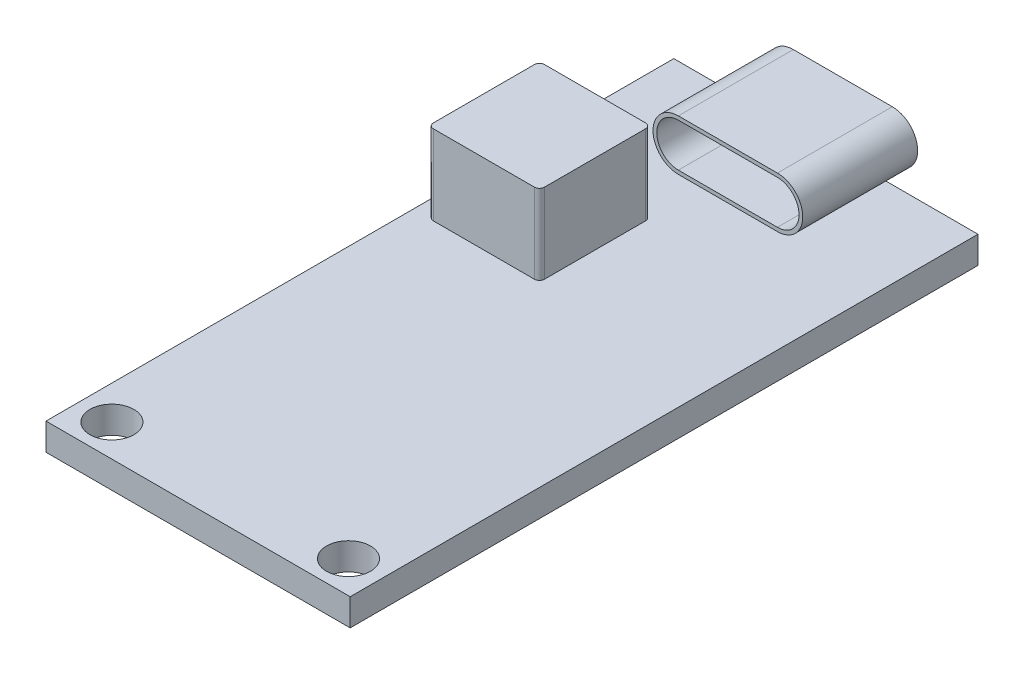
ISO-10303-21;
HEADER;
FILE_DESCRIPTION(('STEP AP214'),'2;1');
FILE_NAME('part.step','',(''),(''),'','','');
FILE_SCHEMA(('AUTOMOTIVE_DESIGN { 1 0 10303 214 1 1 1 1 }'));
ENDSEC;
DATA;
#1=APPLICATION_CONTEXT('core data for automotive mechanical design processes');
#2=APPLICATION_PROTOCOL_DEFINITION('international standard','automotive_design',2000,#1);
#3=PRODUCT_CONTEXT('',#1,'mechanical');
#4=PRODUCT('Part','Part','',(#3));
#5=PRODUCT_RELATED_PRODUCT_CATEGORY('part','',(#4));
#6=PRODUCT_DEFINITION_FORMATION('','',#4);
#7=PRODUCT_DEFINITION_CONTEXT('part definition',#1,'design');
#8=PRODUCT_DEFINITION('design','',#6,#7);
#9=PRODUCT_DEFINITION_SHAPE('','',#8);
#10=(LENGTH_UNIT() NAMED_UNIT(*) SI_UNIT(.MILLI.,.METRE.));
#11=(NAMED_UNIT(*) PLANE_ANGLE_UNIT() SI_UNIT($,.RADIAN.));
#12=(NAMED_UNIT(*) SI_UNIT($,.STERADIAN.) SOLID_ANGLE_UNIT());
#13=UNCERTAINTY_MEASURE_WITH_UNIT(LENGTH_MEASURE(1.E-05),#10,'distance_accuracy_value','');
#14=(GEOMETRIC_REPRESENTATION_CONTEXT(3) GLOBAL_UNCERTAINTY_ASSIGNED_CONTEXT((#13)) GLOBAL_UNIT_ASSIGNED_CONTEXT((#10,
#11,#12)) REPRESENTATION_CONTEXT('',''));
#15=CARTESIAN_POINT('',(0.,0.,0.));
#16=DIRECTION('',(0.,0.,1.));
#17=DIRECTION('',(1.,0.,0.));
#18=AXIS2_PLACEMENT_3D('',#15,#16,#17);
#19=CARTESIAN_POINT('',(0.,1.6,0.));
#20=DIRECTION('',(0.,1.,0.));
#21=DIRECTION('',(0.,0.,1.));
#22=AXIS2_PLACEMENT_3D('',#19,#20,#21);
#23=PLANE('',#22);
#24=CARTESIAN_POINT('',(-7.,1.6,16.675));
#25=DIRECTION('',(0.,1.,0.));
#26=DIRECTION('',(0.,0.,1.));
#27=AXIS2_PLACEMENT_3D('',#24,#25,#26);
#28=CIRCLE('',#27,1.3);
#29=CARTESIAN_POINT('',(-7.,1.6,17.975));
#30=VERTEX_POINT('',#29);
#31=EDGE_CURVE('E296',#30,#30,#28,.T.);
#32=ORIENTED_EDGE('',*,*,#31,.F.);
#33=EDGE_LOOP('',(#32));
#34=FACE_BOUND('',#33,.T.);
#35=CARTESIAN_POINT('',(7.,1.6,16.675));
#36=DIRECTION('',(0.,1.,0.));
#37=DIRECTION('',(0.,0.,1.));
#38=AXIS2_PLACEMENT_3D('',#35,#36,#37);
#39=CIRCLE('',#38,1.3);
#40=CARTESIAN_POINT('',(7.,1.6,17.975));
#41=VERTEX_POINT('',#40);
#42=EDGE_CURVE('E300',#41,#41,#39,.T.);
#43=ORIENTED_EDGE('',*,*,#42,.F.);
#44=EDGE_LOOP('',(#43));
#45=FACE_BOUND('',#44,.T.);
#46=DIRECTION('',(-1.,0.,0.));
#47=VECTOR('',#46,1.);
#48=CARTESIAN_POINT('',(-2.93,1.6,-12.775));
#49=LINE('',#48,#47);
#50=CARTESIAN_POINT('',(2.93,1.6,-12.775));
#51=VERTEX_POINT('',#50);
#52=CARTESIAN_POINT('',(-2.93,1.6,-12.775));
#53=VERTEX_POINT('',#52);
#54=EDGE_CURVE('E270',#51,#53,#49,.T.);
#55=ORIENTED_EDGE('',*,*,#54,.T.);
#56=DIRECTION('',(0.,0.,-1.));
#57=VECTOR('',#56,1.);
#58=CARTESIAN_POINT('',(-2.93,1.6,-12.775));
#59=LINE('',#58,#57);
#60=CARTESIAN_POINT('',(-2.93,1.6,-18.575));
#61=VERTEX_POINT('',#60);
#62=EDGE_CURVE('E275',#53,#61,#59,.T.);
#63=ORIENTED_EDGE('',*,*,#62,.T.);
#64=DIRECTION('',(-1.,0.,0.));
#65=VECTOR('',#64,1.);
#66=CARTESIAN_POINT('',(9.,1.6,-18.575));
#67=LINE('',#66,#65);
#68=CARTESIAN_POINT('',(-9.,1.6,-18.575));
#69=VERTEX_POINT('',#68);
#70=EDGE_CURVE('E318',#61,#69,#67,.T.);
#71=ORIENTED_EDGE('',*,*,#70,.T.);
#72=DIRECTION('',(0.,0.,1.));
#73=VECTOR('',#72,1.);
#74=CARTESIAN_POINT('',(-9.,1.6,18.575));
#75=LINE('',#74,#73);
#76=CARTESIAN_POINT('',(-9.,1.6,18.575));
#77=VERTEX_POINT('',#76);
#78=EDGE_CURVE('E307',#69,#77,#75,.T.);
#79=ORIENTED_EDGE('',*,*,#78,.T.);
#80=DIRECTION('',(1.,0.,0.));
#81=VECTOR('',#80,1.);
#82=CARTESIAN_POINT('',(9.,1.6,18.575));
#83=LINE('',#82,#81);
#84=CARTESIAN_POINT('',(9.,1.6,18.575));
#85=VERTEX_POINT('',#84);
#86=EDGE_CURVE('E311',#77,#85,#83,.T.);
#87=ORIENTED_EDGE('',*,*,#86,.T.);
#88=DIRECTION('',(0.,0.,-1.));
#89=VECTOR('',#88,1.);
#90=CARTESIAN_POINT('',(9.,1.6,18.575));
#91=LINE('',#90,#89);
#92=CARTESIAN_POINT('',(9.,1.6,-18.575));
#93=VERTEX_POINT('',#92);
#94=EDGE_CURVE('E315',#85,#93,#91,.T.);
#95=ORIENTED_EDGE('',*,*,#94,.T.);
#96=CARTESIAN_POINT('',(2.93,1.6,-18.575));
#97=VERTEX_POINT('',#96);
#98=EDGE_CURVE('E319',#93,#97,#67,.T.);
#99=ORIENTED_EDGE('',*,*,#98,.T.);
#100=DIRECTION('',(0.,0.,-1.));
#101=VECTOR('',#100,1.);
#102=CARTESIAN_POINT('',(2.93,1.6,-12.775));
#103=LINE('',#102,#101);
#104=EDGE_CURVE('E281',#51,#97,#103,.T.);
#105=ORIENTED_EDGE('',*,*,#104,.F.);
#106=EDGE_LOOP('',(#55,#63,#71,#79,#87,#95,#99,#105));
#107=FACE_BOUND('',#106,.T.);
#108=DIRECTION('',(-1.,0.,0.));
#109=VECTOR('',#108,1.);
#110=CARTESIAN_POINT('',(-8.1,1.6,-9.72500000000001));
#111=LINE('',#110,#109);
#112=CARTESIAN_POINT('',(-1.82,1.6,-9.72500000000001));
#113=VERTEX_POINT('',#112);
#114=CARTESIAN_POINT('',(-7.8,1.6,-9.72500000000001));
#115=VERTEX_POINT('',#114);
#116=EDGE_CURVE('E407',#113,#115,#111,.T.);
#117=ORIENTED_EDGE('',*,*,#116,.F.);
#118=CARTESIAN_POINT('',(-1.82,1.6,-9.42500000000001));
#119=DIRECTION('',(0.,1.,0.));
#120=DIRECTION('',(0.,0.,1.));
#121=AXIS2_PLACEMENT_3D('',#118,#119,#120);
#122=CIRCLE('',#121,0.3);
#123=CARTESIAN_POINT('',(-1.52,1.6,-9.42500000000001));
#124=VERTEX_POINT('',#123);
#125=EDGE_CURVE('E393',#113,#124,#122,.F.);
#126=ORIENTED_EDGE('',*,*,#125,.T.);
#127=DIRECTION('',(0.,0.,-1.));
#128=VECTOR('',#127,1.);
#129=CARTESIAN_POINT('',(-1.52,1.6,-9.72500000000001));
#130=LINE('',#129,#128);
#131=CARTESIAN_POINT('',(-1.52,1.6,-3.44500000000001));
#132=VERTEX_POINT('',#131);
#133=EDGE_CURVE('E428',#132,#124,#130,.T.);
#134=ORIENTED_EDGE('',*,*,#133,.F.);
#135=CARTESIAN_POINT('',(-1.82,1.6,-3.44500000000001));
#136=DIRECTION('',(0.,1.,0.));
#137=DIRECTION('',(0.,0.,1.));
#138=AXIS2_PLACEMENT_3D('',#135,#136,#137);
#139=CIRCLE('',#138,0.3);
#140=CARTESIAN_POINT('',(-1.82,1.6,-3.14500000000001));
#141=VERTEX_POINT('',#140);
#142=EDGE_CURVE('E11',#132,#141,#139,.F.);
#143=ORIENTED_EDGE('',*,*,#142,.T.);
#144=DIRECTION('',(1.,0.,0.));
#145=VECTOR('',#144,1.);
#146=CARTESIAN_POINT('',(-8.1,1.6,-3.14500000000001));
#147=LINE('',#146,#145);
#148=CARTESIAN_POINT('',(-7.8,1.6,-3.14500000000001));
#149=VERTEX_POINT('',#148);
#150=EDGE_CURVE('E400',#149,#141,#147,.T.);
#151=ORIENTED_EDGE('',*,*,#150,.F.);
#152=CARTESIAN_POINT('',(-7.8,1.6,-3.44500000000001));
#153=DIRECTION('',(0.,1.,0.));
#154=DIRECTION('',(0.,0.,1.));
#155=AXIS2_PLACEMENT_3D('',#152,#153,#154);
#156=CIRCLE('',#155,0.3);
#157=CARTESIAN_POINT('',(-8.1,1.6,-3.44500000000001));
#158=VERTEX_POINT('',#157);
#159=EDGE_CURVE('E52',#149,#158,#156,.F.);
#160=ORIENTED_EDGE('',*,*,#159,.T.);
#161=DIRECTION('',(0.,0.,1.));
#162=VECTOR('',#161,1.);
#163=CARTESIAN_POINT('',(-8.1,1.6,-9.72500000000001));
#164=LINE('',#163,#162);
#165=CARTESIAN_POINT('',(-8.1,1.6,-9.42500000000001));
#166=VERTEX_POINT('',#165);
#167=EDGE_CURVE('E399',#166,#158,#164,.T.);
#168=ORIENTED_EDGE('',*,*,#167,.F.);
#169=CARTESIAN_POINT('',(-7.8,1.6,-9.42500000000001));
#170=DIRECTION('',(0.,1.,0.));
#171=DIRECTION('',(0.,0.,1.));
#172=AXIS2_PLACEMENT_3D('',#169,#170,#171);
#173=CIRCLE('',#172,0.3);
#174=EDGE_CURVE('E390',#166,#115,#173,.F.);
#175=ORIENTED_EDGE('',*,*,#174,.T.);
#176=EDGE_LOOP('',(#117,#126,#134,#143,#151,#160,#168,#175));
#177=FACE_BOUND('',#176,.T.);
#178=ADVANCED_FACE('F43',(#34,#45,#107,#177),#23,.T.);
#179=CARTESIAN_POINT('',(-9.,1.6,18.575));
#180=DIRECTION('',(1.,0.,0.));
#181=DIRECTION('',(0.,0.,-1.));
#182=AXIS2_PLACEMENT_3D('',#179,#180,#181);
#183=PLANE('',#182);
#184=DIRECTION('',(0.,0.,1.));
#185=VECTOR('',#184,1.);
#186=CARTESIAN_POINT('',(-9.,0.,18.575));
#187=LINE('',#186,#185);
#188=CARTESIAN_POINT('',(-9.,0.,-18.575));
#189=VERTEX_POINT('',#188);
#190=CARTESIAN_POINT('',(-9.,0.,18.575));
#191=VERTEX_POINT('',#190);
#192=EDGE_CURVE('E295',#189,#191,#187,.T.);
#193=ORIENTED_EDGE('',*,*,#192,.T.);
#194=DIRECTION('',(0.,-1.,0.));
#195=VECTOR('',#194,1.);
#196=CARTESIAN_POINT('',(-9.,1.6,18.575));
#197=LINE('',#196,#195);
#198=EDGE_CURVE('E347',#77,#191,#197,.T.);
#199=ORIENTED_EDGE('',*,*,#198,.F.);
#200=ORIENTED_EDGE('',*,*,#78,.F.);
#201=DIRECTION('',(0.,-1.,0.));
#202=VECTOR('',#201,1.);
#203=CARTESIAN_POINT('',(-9.,1.6,-18.575));
#204=LINE('',#203,#202);
#205=EDGE_CURVE('E323',#69,#189,#204,.T.);
#206=ORIENTED_EDGE('',*,*,#205,.T.);
#207=EDGE_LOOP('',(#193,#199,#200,#206));
#208=FACE_BOUND('',#207,.T.);
#209=ADVANCED_FACE('F462',(#208),#183,.F.);
#210=CARTESIAN_POINT('',(9.,1.6,18.575));
#211=DIRECTION('',(0.,0.,-1.));
#212=DIRECTION('',(-1.,0.,0.));
#213=AXIS2_PLACEMENT_3D('',#210,#211,#212);
#214=PLANE('',#213);
#215=DIRECTION('',(1.,0.,0.));
#216=VECTOR('',#215,1.);
#217=CARTESIAN_POINT('',(9.,0.,18.575));
#218=LINE('',#217,#216);
#219=CARTESIAN_POINT('',(9.,0.,18.575));
#220=VERTEX_POINT('',#219);
#221=EDGE_CURVE('E328',#191,#220,#218,.T.);
#222=ORIENTED_EDGE('',*,*,#221,.T.);
#223=DIRECTION('',(0.,-1.,0.));
#224=VECTOR('',#223,1.);
#225=CARTESIAN_POINT('',(9.,1.6,18.575));
#226=LINE('',#225,#224);
#227=EDGE_CURVE('E343',#85,#220,#226,.T.);
#228=ORIENTED_EDGE('',*,*,#227,.F.);
#229=ORIENTED_EDGE('',*,*,#86,.F.);
#230=ORIENTED_EDGE('',*,*,#198,.T.);
#231=EDGE_LOOP('',(#222,#228,#229,#230));
#232=FACE_BOUND('',#231,.T.);
#233=ADVANCED_FACE('F468',(#232),#214,.F.);
#234=CARTESIAN_POINT('',(9.,1.6,18.575));
#235=DIRECTION('',(-1.,0.,0.));
#236=DIRECTION('',(0.,0.,1.));
#237=AXIS2_PLACEMENT_3D('',#234,#235,#236);
#238=PLANE('',#237);
#239=DIRECTION('',(0.,0.,-1.));
#240=VECTOR('',#239,1.);
#241=CARTESIAN_POINT('',(9.,0.,18.575));
#242=LINE('',#241,#240);
#243=CARTESIAN_POINT('',(9.,0.,-18.575));
#244=VERTEX_POINT('',#243);
#245=EDGE_CURVE('E331',#220,#244,#242,.T.);
#246=ORIENTED_EDGE('',*,*,#245,.T.);
#247=DIRECTION('',(0.,-1.,0.));
#248=VECTOR('',#247,1.);
#249=CARTESIAN_POINT('',(9.,1.6,-18.575));
#250=LINE('',#249,#248);
#251=EDGE_CURVE('E339',#93,#244,#250,.T.);
#252=ORIENTED_EDGE('',*,*,#251,.F.);
#253=ORIENTED_EDGE('',*,*,#94,.F.);
#254=ORIENTED_EDGE('',*,*,#227,.T.);
#255=EDGE_LOOP('',(#246,#252,#253,#254));
#256=FACE_BOUND('',#255,.T.);
#257=ADVANCED_FACE('F484',(#256),#238,.F.);
#258=CARTESIAN_POINT('',(9.,1.6,-18.575));
#259=DIRECTION('',(0.,0.,1.));
#260=DIRECTION('',(1.,0.,0.));
#261=AXIS2_PLACEMENT_3D('',#258,#259,#260);
#262=PLANE('',#261);
#263=DIRECTION('',(-1.,0.,0.));
#264=VECTOR('',#263,1.);
#265=CARTESIAN_POINT('',(9.,0.,-18.575));
#266=LINE('',#265,#264);
#267=EDGE_CURVE('E312',#244,#189,#266,.T.);
#268=ORIENTED_EDGE('',*,*,#267,.T.);
#269=ORIENTED_EDGE('',*,*,#205,.F.);
#270=ORIENTED_EDGE('',*,*,#70,.F.);
#271=EDGE_CURVE('E324',#97,#61,#67,.T.);
#272=ORIENTED_EDGE('',*,*,#271,.F.);
#273=ORIENTED_EDGE('',*,*,#98,.F.);
#274=ORIENTED_EDGE('',*,*,#251,.T.);
#275=EDGE_LOOP('',(#268,#269,#270,#272,#273,#274));
#276=FACE_BOUND('',#275,.T.);
#277=ADVANCED_FACE('F480',(#276),#262,.F.);
#278=CARTESIAN_POINT('',(0.,0.,0.));
#279=DIRECTION('',(0.,1.,0.));
#280=DIRECTION('',(0.,0.,1.));
#281=AXIS2_PLACEMENT_3D('',#278,#279,#280);
#282=PLANE('',#281);
#283=CARTESIAN_POINT('',(-7.,0.,16.675));
#284=DIRECTION('',(0.,1.,0.));
#285=DIRECTION('',(0.,0.,1.));
#286=AXIS2_PLACEMENT_3D('',#283,#284,#285);
#287=CIRCLE('',#286,1.3);
#288=CARTESIAN_POINT('',(-7.,0.,17.975));
#289=VERTEX_POINT('',#288);
#290=EDGE_CURVE('E291',#289,#289,#287,.T.);
#291=ORIENTED_EDGE('',*,*,#290,.T.);
#292=EDGE_LOOP('',(#291));
#293=FACE_BOUND('',#292,.T.);
#294=CARTESIAN_POINT('',(7.,0.,16.675));
#295=DIRECTION('',(0.,1.,0.));
#296=DIRECTION('',(0.,0.,1.));
#297=AXIS2_PLACEMENT_3D('',#294,#295,#296);
#298=CIRCLE('',#297,1.3);
#299=CARTESIAN_POINT('',(7.,0.,17.975));
#300=VERTEX_POINT('',#299);
#301=EDGE_CURVE('E279',#300,#300,#298,.T.);
#302=ORIENTED_EDGE('',*,*,#301,.T.);
#303=EDGE_LOOP('',(#302));
#304=FACE_BOUND('',#303,.T.);
#305=ORIENTED_EDGE('',*,*,#192,.F.);
#306=ORIENTED_EDGE('',*,*,#267,.F.);
#307=ORIENTED_EDGE('',*,*,#245,.F.);
#308=ORIENTED_EDGE('',*,*,#221,.F.);
#309=EDGE_LOOP('',(#305,#306,#307,#308));
#310=FACE_BOUND('',#309,.T.);
#311=ADVANCED_FACE('F477',(#293,#304,#310),#282,.F.);
#312=CARTESIAN_POINT('',(7.,0.,16.675));
#313=DIRECTION('',(0.,1.,0.));
#314=DIRECTION('',(0.,0.,1.));
#315=AXIS2_PLACEMENT_3D('',#312,#313,#314);
#316=CYLINDRICAL_SURFACE('',#315,1.3);
#317=ORIENTED_EDGE('',*,*,#301,.F.);
#318=EDGE_LOOP('',(#317));
#319=FACE_BOUND('',#318,.T.);
#320=ORIENTED_EDGE('',*,*,#42,.T.);
#321=EDGE_LOOP('',(#320));
#322=FACE_BOUND('',#321,.T.);
#323=ADVANCED_FACE('F475',(#319,#322),#316,.F.);
#324=CARTESIAN_POINT('',(-7.,0.,16.675));
#325=DIRECTION('',(0.,1.,0.));
#326=DIRECTION('',(0.,0.,1.));
#327=AXIS2_PLACEMENT_3D('',#324,#325,#326);
#328=CYLINDRICAL_SURFACE('',#327,1.3);
#329=ORIENTED_EDGE('',*,*,#290,.F.);
#330=EDGE_LOOP('',(#329));
#331=FACE_BOUND('',#330,.T.);
#332=ORIENTED_EDGE('',*,*,#31,.T.);
#333=EDGE_LOOP('',(#332));
#334=FACE_BOUND('',#333,.T.);
#335=ADVANCED_FACE('F660',(#331,#334),#328,.F.);
#336=CARTESIAN_POINT('',(-2.93,1.6,-12.775));
#337=DIRECTION('',(0.,-1.,0.));
#338=DIRECTION('',(0.,0.,-1.));
#339=AXIS2_PLACEMENT_3D('',#336,#337,#338);
#340=PLANE('',#339);
#341=ORIENTED_EDGE('',*,*,#271,.T.);
#342=CARTESIAN_POINT('',(-2.93,1.6,-19.575));
#343=VERTEX_POINT('',#342);
#344=EDGE_CURVE('E280',#61,#343,#59,.T.);
#345=ORIENTED_EDGE('',*,*,#344,.T.);
#346=DIRECTION('',(-1.,0.,0.));
#347=VECTOR('',#346,1.);
#348=CARTESIAN_POINT('',(-2.93,1.6,-19.575));
#349=LINE('',#348,#347);
#350=CARTESIAN_POINT('',(2.93,1.6,-19.575));
#351=VERTEX_POINT('',#350);
#352=EDGE_CURVE('E236',#351,#343,#349,.T.);
#353=ORIENTED_EDGE('',*,*,#352,.F.);
#354=EDGE_CURVE('E285',#97,#351,#103,.T.);
#355=ORIENTED_EDGE('',*,*,#354,.F.);
#356=EDGE_LOOP('',(#341,#345,#353,#355));
#357=FACE_BOUND('',#356,.T.);
#358=ADVANCED_FACE('F650',(#357),#340,.T.);
#359=CARTESIAN_POINT('',(-2.93,3.1,-12.775));
#360=DIRECTION('',(0.,0.,-1.));
#361=DIRECTION('',(-1.,0.,0.));
#362=AXIS2_PLACEMENT_3D('',#359,#360,#361);
#363=CYLINDRICAL_SURFACE('',#362,1.5);
#364=DIRECTION('',(0.,0.,-1.));
#365=VECTOR('',#364,1.);
#366=CARTESIAN_POINT('',(-2.93,4.6,-12.775));
#367=LINE('',#366,#365);
#368=CARTESIAN_POINT('',(-2.93,4.6,-12.775));
#369=VERTEX_POINT('',#368);
#370=CARTESIAN_POINT('',(-2.93,4.6,-19.575));
#371=VERTEX_POINT('',#370);
#372=EDGE_CURVE('E274',#369,#371,#367,.T.);
#373=ORIENTED_EDGE('',*,*,#372,.T.);
#374=CARTESIAN_POINT('',(-2.93,3.1,-19.575));
#375=DIRECTION('',(0.,0.,-1.));
#376=DIRECTION('',(-1.,0.,0.));
#377=AXIS2_PLACEMENT_3D('',#374,#375,#376);
#378=CIRCLE('',#377,1.5);
#379=EDGE_CURVE('E224',#343,#371,#378,.T.);
#380=ORIENTED_EDGE('',*,*,#379,.F.);
#381=ORIENTED_EDGE('',*,*,#344,.F.);
#382=ORIENTED_EDGE('',*,*,#62,.F.);
#383=CARTESIAN_POINT('',(-2.93,3.1,-12.775));
#384=DIRECTION('',(0.,0.,-1.));
#385=DIRECTION('',(-1.,0.,0.));
#386=AXIS2_PLACEMENT_3D('',#383,#384,#385);
#387=CIRCLE('',#386,1.5);
#388=EDGE_CURVE('E254',#53,#369,#387,.T.);
#389=ORIENTED_EDGE('',*,*,#388,.T.);
#390=EDGE_LOOP('',(#373,#380,#381,#382,#389));
#391=FACE_BOUND('',#390,.T.);
#392=ADVANCED_FACE('F640',(#391),#363,.T.);
#393=CARTESIAN_POINT('',(2.93,3.1,-12.775));
#394=DIRECTION('',(0.,0.,-1.));
#395=DIRECTION('',(-1.,0.,0.));
#396=AXIS2_PLACEMENT_3D('',#393,#394,#395);
#397=CYLINDRICAL_SURFACE('',#396,1.5);
#398=ORIENTED_EDGE('',*,*,#104,.T.);
#399=ORIENTED_EDGE('',*,*,#354,.T.);
#400=CARTESIAN_POINT('',(2.93,3.1,-19.575));
#401=DIRECTION('',(0.,0.,-1.));
#402=DIRECTION('',(-1.,0.,0.));
#403=AXIS2_PLACEMENT_3D('',#400,#401,#402);
#404=CIRCLE('',#403,1.5);
#405=CARTESIAN_POINT('',(2.93,4.6,-19.575));
#406=VERTEX_POINT('',#405);
#407=EDGE_CURVE('E232',#406,#351,#404,.T.);
#408=ORIENTED_EDGE('',*,*,#407,.F.);
#409=DIRECTION('',(0.,0.,-1.));
#410=VECTOR('',#409,1.);
#411=CARTESIAN_POINT('',(2.93,4.6,-12.775));
#412=LINE('',#411,#410);
#413=CARTESIAN_POINT('',(2.93,4.6,-12.775));
#414=VERTEX_POINT('',#413);
#415=EDGE_CURVE('E286',#414,#406,#412,.T.);
#416=ORIENTED_EDGE('',*,*,#415,.F.);
#417=CARTESIAN_POINT('',(2.93,3.1,-12.775));
#418=DIRECTION('',(0.,0.,-1.));
#419=DIRECTION('',(-1.,0.,0.));
#420=AXIS2_PLACEMENT_3D('',#417,#418,#419);
#421=CIRCLE('',#420,1.5);
#422=EDGE_CURVE('E267',#414,#51,#421,.T.);
#423=ORIENTED_EDGE('',*,*,#422,.T.);
#424=EDGE_LOOP('',(#398,#399,#408,#416,#423));
#425=FACE_BOUND('',#424,.T.);
#426=ADVANCED_FACE('F630',(#425),#397,.T.);
#427=CARTESIAN_POINT('',(-2.93,4.6,-12.775));
#428=DIRECTION('',(0.,1.,0.));
#429=DIRECTION('',(0.,0.,1.));
#430=AXIS2_PLACEMENT_3D('',#427,#428,#429);
#431=PLANE('',#430);
#432=ORIENTED_EDGE('',*,*,#415,.T.);
#433=DIRECTION('',(1.,0.,0.));
#434=VECTOR('',#433,1.);
#435=CARTESIAN_POINT('',(-2.93,4.6,-19.575));
#436=LINE('',#435,#434);
#437=EDGE_CURVE('E228',#371,#406,#436,.T.);
#438=ORIENTED_EDGE('',*,*,#437,.F.);
#439=ORIENTED_EDGE('',*,*,#372,.F.);
#440=DIRECTION('',(1.,0.,0.));
#441=VECTOR('',#440,1.);
#442=CARTESIAN_POINT('',(-2.93,4.6,-12.775));
#443=LINE('',#442,#441);
#444=EDGE_CURVE('E263',#369,#414,#443,.T.);
#445=ORIENTED_EDGE('',*,*,#444,.T.);
#446=EDGE_LOOP('',(#432,#438,#439,#445));
#447=FACE_BOUND('',#446,.T.);
#448=ADVANCED_FACE('F620',(#447),#431,.T.);
#449=CARTESIAN_POINT('',(-2.93,3.1,-12.775));
#450=DIRECTION('',(0.,0.,-1.));
#451=DIRECTION('',(-1.,0.,0.));
#452=AXIS2_PLACEMENT_3D('',#449,#450,#451);
#453=PLANE('',#452);
#454=DIRECTION('',(-1.,0.,0.));
#455=VECTOR('',#454,1.);
#456=CARTESIAN_POINT('',(-2.93,1.82,-12.775));
#457=LINE('',#456,#455);
#458=CARTESIAN_POINT('',(2.93,1.82,-12.775));
#459=VERTEX_POINT('',#458);
#460=CARTESIAN_POINT('',(-2.93,1.82,-12.775));
#461=VERTEX_POINT('',#460);
#462=EDGE_CURVE('E200',#459,#461,#457,.T.);
#463=ORIENTED_EDGE('',*,*,#462,.T.);
#464=CARTESIAN_POINT('',(-2.93,3.1,-12.775));
#465=DIRECTION('',(0.,0.,-1.));
#466=DIRECTION('',(-1.,0.,0.));
#467=AXIS2_PLACEMENT_3D('',#464,#465,#466);
#468=CIRCLE('',#467,1.28);
#469=CARTESIAN_POINT('',(-2.93,4.38,-12.775));
#470=VERTEX_POINT('',#469);
#471=EDGE_CURVE('E240',#461,#470,#468,.T.);
#472=ORIENTED_EDGE('',*,*,#471,.T.);
#473=DIRECTION('',(1.,0.,0.));
#474=VECTOR('',#473,1.);
#475=CARTESIAN_POINT('',(-2.93,4.38,-12.775));
#476=LINE('',#475,#474);
#477=CARTESIAN_POINT('',(2.93,4.38,-12.775));
#478=VERTEX_POINT('',#477);
#479=EDGE_CURVE('E194',#470,#478,#476,.T.);
#480=ORIENTED_EDGE('',*,*,#479,.T.);
#481=CARTESIAN_POINT('',(2.93,3.1,-12.775));
#482=DIRECTION('',(0.,0.,-1.));
#483=DIRECTION('',(-1.,0.,0.));
#484=AXIS2_PLACEMENT_3D('',#481,#482,#483);
#485=CIRCLE('',#484,1.28);
#486=EDGE_CURVE('E245',#478,#459,#485,.T.);
#487=ORIENTED_EDGE('',*,*,#486,.T.);
#488=EDGE_LOOP('',(#463,#472,#480,#487));
#489=FACE_BOUND('',#488,.T.);
#490=ORIENTED_EDGE('',*,*,#388,.F.);
#491=ORIENTED_EDGE('',*,*,#54,.F.);
#492=ORIENTED_EDGE('',*,*,#422,.F.);
#493=ORIENTED_EDGE('',*,*,#444,.F.);
#494=EDGE_LOOP('',(#490,#491,#492,#493));
#495=FACE_BOUND('',#494,.T.);
#496=ADVANCED_FACE('F611',(#489,#495),#453,.F.);
#497=CARTESIAN_POINT('',(-2.93,3.1,-12.775));
#498=DIRECTION('',(0.,0.,-1.));
#499=DIRECTION('',(-1.,0.,0.));
#500=AXIS2_PLACEMENT_3D('',#497,#498,#499);
#501=CYLINDRICAL_SURFACE('',#500,1.28);
#502=DIRECTION('',(0.,0.,-1.));
#503=VECTOR('',#502,1.);
#504=CARTESIAN_POINT('',(-2.93,1.82,-12.775));
#505=LINE('',#504,#503);
#506=CARTESIAN_POINT('',(-2.93,1.82,-19.575));
#507=VERTEX_POINT('',#506);
#508=EDGE_CURVE('E205',#461,#507,#505,.T.);
#509=ORIENTED_EDGE('',*,*,#508,.T.);
#510=CARTESIAN_POINT('',(-2.93,3.1,-19.575));
#511=DIRECTION('',(0.,0.,-1.));
#512=DIRECTION('',(-1.,0.,0.));
#513=AXIS2_PLACEMENT_3D('',#510,#511,#512);
#514=CIRCLE('',#513,1.28);
#515=CARTESIAN_POINT('',(-2.93,4.38,-19.575));
#516=VERTEX_POINT('',#515);
#517=EDGE_CURVE('E203',#507,#516,#514,.T.);
#518=ORIENTED_EDGE('',*,*,#517,.T.);
#519=DIRECTION('',(0.,0.,-1.));
#520=VECTOR('',#519,1.);
#521=CARTESIAN_POINT('',(-2.93,4.38,-12.775));
#522=LINE('',#521,#520);
#523=EDGE_CURVE('E186',#470,#516,#522,.T.);
#524=ORIENTED_EDGE('',*,*,#523,.F.);
#525=ORIENTED_EDGE('',*,*,#471,.F.);
#526=EDGE_LOOP('',(#509,#518,#524,#525));
#527=FACE_BOUND('',#526,.T.);
#528=ADVANCED_FACE('F204',(#527),#501,.F.);
#529=CARTESIAN_POINT('',(-2.93,1.82,-12.775));
#530=DIRECTION('',(0.,-1.,0.));
#531=DIRECTION('',(0.,0.,-1.));
#532=AXIS2_PLACEMENT_3D('',#529,#530,#531);
#533=PLANE('',#532);
#534=DIRECTION('',(0.,0.,-1.));
#535=VECTOR('',#534,1.);
#536=CARTESIAN_POINT('',(2.93,1.82,-12.775));
#537=LINE('',#536,#535);
#538=CARTESIAN_POINT('',(2.93,1.82,-19.575));
#539=VERTEX_POINT('',#538);
#540=EDGE_CURVE('E255',#459,#539,#537,.T.);
#541=ORIENTED_EDGE('',*,*,#540,.T.);
#542=DIRECTION('',(-1.,0.,0.));
#543=VECTOR('',#542,1.);
#544=CARTESIAN_POINT('',(-2.93,1.82,-19.575));
#545=LINE('',#544,#543);
#546=EDGE_CURVE('E218',#539,#507,#545,.T.);
#547=ORIENTED_EDGE('',*,*,#546,.T.);
#548=ORIENTED_EDGE('',*,*,#508,.F.);
#549=ORIENTED_EDGE('',*,*,#462,.F.);
#550=EDGE_LOOP('',(#541,#547,#548,#549));
#551=FACE_BOUND('',#550,.T.);
#552=ADVANCED_FACE('F592',(#551),#533,.F.);
#553=CARTESIAN_POINT('',(2.93,3.1,-12.775));
#554=DIRECTION('',(0.,0.,-1.));
#555=DIRECTION('',(-1.,0.,0.));
#556=AXIS2_PLACEMENT_3D('',#553,#554,#555);
#557=CYLINDRICAL_SURFACE('',#556,1.28);
#558=DIRECTION('',(0.,0.,-1.));
#559=VECTOR('',#558,1.);
#560=CARTESIAN_POINT('',(2.93,4.38,-12.775));
#561=LINE('',#560,#559);
#562=CARTESIAN_POINT('',(2.93,4.38,-19.575));
#563=VERTEX_POINT('',#562);
#564=EDGE_CURVE('E199',#478,#563,#561,.T.);
#565=ORIENTED_EDGE('',*,*,#564,.T.);
#566=CARTESIAN_POINT('',(2.93,3.1,-19.575));
#567=DIRECTION('',(0.,0.,-1.));
#568=DIRECTION('',(-1.,0.,0.));
#569=AXIS2_PLACEMENT_3D('',#566,#567,#568);
#570=CIRCLE('',#569,1.28);
#571=EDGE_CURVE('E214',#563,#539,#570,.T.);
#572=ORIENTED_EDGE('',*,*,#571,.T.);
#573=ORIENTED_EDGE('',*,*,#540,.F.);
#574=ORIENTED_EDGE('',*,*,#486,.F.);
#575=EDGE_LOOP('',(#565,#572,#573,#574));
#576=FACE_BOUND('',#575,.T.);
#577=ADVANCED_FACE('F583',(#576),#557,.F.);
#578=CARTESIAN_POINT('',(-2.93,4.38,-12.775));
#579=DIRECTION('',(0.,1.,0.));
#580=DIRECTION('',(0.,0.,1.));
#581=AXIS2_PLACEMENT_3D('',#578,#579,#580);
#582=PLANE('',#581);
#583=ORIENTED_EDGE('',*,*,#523,.T.);
#584=DIRECTION('',(1.,0.,0.));
#585=VECTOR('',#584,1.);
#586=CARTESIAN_POINT('',(-2.93,4.38,-19.575));
#587=LINE('',#586,#585);
#588=EDGE_CURVE('E191',#516,#563,#587,.T.);
#589=ORIENTED_EDGE('',*,*,#588,.T.);
#590=ORIENTED_EDGE('',*,*,#564,.F.);
#591=ORIENTED_EDGE('',*,*,#479,.F.);
#592=EDGE_LOOP('',(#583,#589,#590,#591));
#593=FACE_BOUND('',#592,.T.);
#594=ADVANCED_FACE('F188',(#593),#582,.F.);
#595=CARTESIAN_POINT('',(-2.93,3.1,-19.575));
#596=DIRECTION('',(0.,0.,-1.));
#597=DIRECTION('',(-1.,0.,0.));
#598=AXIS2_PLACEMENT_3D('',#595,#596,#597);
#599=PLANE('',#598);
#600=ORIENTED_EDGE('',*,*,#379,.T.);
#601=ORIENTED_EDGE('',*,*,#437,.T.);
#602=ORIENTED_EDGE('',*,*,#407,.T.);
#603=ORIENTED_EDGE('',*,*,#352,.T.);
#604=EDGE_LOOP('',(#600,#601,#602,#603));
#605=FACE_BOUND('',#604,.T.);
#606=ORIENTED_EDGE('',*,*,#588,.F.);
#607=ORIENTED_EDGE('',*,*,#517,.F.);
#608=ORIENTED_EDGE('',*,*,#546,.F.);
#609=ORIENTED_EDGE('',*,*,#571,.F.);
#610=EDGE_LOOP('',(#606,#607,#608,#609));
#611=FACE_BOUND('',#610,.T.);
#612=ADVANCED_FACE('F212',(#605,#611),#599,.T.);
#613=CARTESIAN_POINT('',(-1.52,6.32,-9.72500000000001));
#614=DIRECTION('',(-1.,0.,0.));
#615=DIRECTION('',(0.,0.,1.));
#616=AXIS2_PLACEMENT_3D('',#613,#614,#615);
#617=PLANE('',#616);
#618=ORIENTED_EDGE('',*,*,#133,.T.);
#619=DIRECTION('',(0.,-1.,0.));
#620=VECTOR('',#619,1.);
#621=CARTESIAN_POINT('',(-1.52,6.32,-9.42500000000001));
#622=LINE('',#621,#620);
#623=CARTESIAN_POINT('',(-1.52,6.32,-9.42500000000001));
#624=VERTEX_POINT('',#623);
#625=EDGE_CURVE('E381',#124,#624,#622,.F.);
#626=ORIENTED_EDGE('',*,*,#625,.T.);
#627=DIRECTION('',(0.,0.,-1.));
#628=VECTOR('',#627,1.);
#629=CARTESIAN_POINT('',(-1.52,6.32,-9.72500000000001));
#630=LINE('',#629,#628);
#631=CARTESIAN_POINT('',(-1.52,6.32,-3.44500000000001));
#632=VERTEX_POINT('',#631);
#633=EDGE_CURVE('E435',#632,#624,#630,.T.);
#634=ORIENTED_EDGE('',*,*,#633,.F.);
#635=DIRECTION('',(0.,-1.,0.));
#636=VECTOR('',#635,1.);
#637=CARTESIAN_POINT('',(-1.52,6.32,-3.44500000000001));
#638=LINE('',#637,#636);
#639=EDGE_CURVE('E377',#632,#132,#638,.T.);
#640=ORIENTED_EDGE('',*,*,#639,.T.);
#641=EDGE_LOOP('',(#618,#626,#634,#640));
#642=FACE_BOUND('',#641,.T.);
#643=ADVANCED_FACE('F454',(#642),#617,.F.);
#644=CARTESIAN_POINT('',(-8.1,6.32,-9.72500000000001));
#645=DIRECTION('',(0.,0.,1.));
#646=DIRECTION('',(1.,0.,0.));
#647=AXIS2_PLACEMENT_3D('',#644,#645,#646);
#648=PLANE('',#647);
#649=ORIENTED_EDGE('',*,*,#116,.T.);
#650=DIRECTION('',(0.,-1.,0.));
#651=VECTOR('',#650,1.);
#652=CARTESIAN_POINT('',(-7.8,6.32,-9.72500000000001));
#653=LINE('',#652,#651);
#654=CARTESIAN_POINT('',(-7.8,6.32,-9.72500000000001));
#655=VERTEX_POINT('',#654);
#656=EDGE_CURVE('E362',#115,#655,#653,.F.);
#657=ORIENTED_EDGE('',*,*,#656,.T.);
#658=DIRECTION('',(-1.,0.,0.));
#659=VECTOR('',#658,1.);
#660=CARTESIAN_POINT('',(-8.1,6.32,-9.72500000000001));
#661=LINE('',#660,#659);
#662=CARTESIAN_POINT('',(-1.82,6.32,-9.72500000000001));
#663=VERTEX_POINT('',#662);
#664=EDGE_CURVE('E424',#663,#655,#661,.T.);
#665=ORIENTED_EDGE('',*,*,#664,.F.);
#666=DIRECTION('',(0.,-1.,0.));
#667=VECTOR('',#666,1.);
#668=CARTESIAN_POINT('',(-1.82,6.32,-9.72500000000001));
#669=LINE('',#668,#667);
#670=EDGE_CURVE('E358',#663,#113,#669,.T.);
#671=ORIENTED_EDGE('',*,*,#670,.T.);
#672=EDGE_LOOP('',(#649,#657,#665,#671));
#673=FACE_BOUND('',#672,.T.);
#674=ADVANCED_FACE('F449',(#673),#648,.F.);
#675=CARTESIAN_POINT('',(-8.1,6.32,-9.72500000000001));
#676=DIRECTION('',(1.,0.,0.));
#677=DIRECTION('',(0.,0.,-1.));
#678=AXIS2_PLACEMENT_3D('',#675,#676,#677);
#679=PLANE('',#678);
#680=DIRECTION('',(0.,0.,1.));
#681=VECTOR('',#680,1.);
#682=CARTESIAN_POINT('',(-8.1,6.32,-9.72500000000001));
#683=LINE('',#682,#681);
#684=CARTESIAN_POINT('',(-8.1,6.32,-9.42500000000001));
#685=VERTEX_POINT('',#684);
#686=CARTESIAN_POINT('',(-8.1,6.32,-3.44500000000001));
#687=VERTEX_POINT('',#686);
#688=EDGE_CURVE('E417',#685,#687,#683,.T.);
#689=ORIENTED_EDGE('',*,*,#688,.F.);
#690=DIRECTION('',(0.,-1.,0.));
#691=VECTOR('',#690,1.);
#692=CARTESIAN_POINT('',(-8.1,6.32,-9.42500000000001));
#693=LINE('',#692,#691);
#694=EDGE_CURVE('E354',#685,#166,#693,.T.);
#695=ORIENTED_EDGE('',*,*,#694,.T.);
#696=ORIENTED_EDGE('',*,*,#167,.T.);
#697=DIRECTION('',(0.,-1.,0.));
#698=VECTOR('',#697,1.);
#699=CARTESIAN_POINT('',(-8.1,6.32,-3.44500000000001));
#700=LINE('',#699,#698);
#701=EDGE_CURVE('E351',#158,#687,#700,.F.);
#702=ORIENTED_EDGE('',*,*,#701,.T.);
#703=EDGE_LOOP('',(#689,#695,#696,#702));
#704=FACE_BOUND('',#703,.T.);
#705=ADVANCED_FACE('F403',(#704),#679,.F.);
#706=CARTESIAN_POINT('',(-8.1,6.32,-3.14500000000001));
#707=DIRECTION('',(0.,0.,-1.));
#708=DIRECTION('',(-1.,0.,0.));
#709=AXIS2_PLACEMENT_3D('',#706,#707,#708);
#710=PLANE('',#709);
#711=DIRECTION('',(1.,0.,0.));
#712=VECTOR('',#711,1.);
#713=CARTESIAN_POINT('',(-8.1,6.32,-3.14500000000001));
#714=LINE('',#713,#712);
#715=CARTESIAN_POINT('',(-7.8,6.32,-3.14500000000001));
#716=VERTEX_POINT('',#715);
#717=CARTESIAN_POINT('',(-1.82,6.32,-3.14500000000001));
#718=VERTEX_POINT('',#717);
#719=EDGE_CURVE('E210',#716,#718,#714,.T.);
#720=ORIENTED_EDGE('',*,*,#719,.F.);
#721=DIRECTION('',(0.,-1.,0.));
#722=VECTOR('',#721,1.);
#723=CARTESIAN_POINT('',(-7.8,6.32,-3.14500000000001));
#724=LINE('',#723,#722);
#725=EDGE_CURVE('E387',#716,#149,#724,.T.);
#726=ORIENTED_EDGE('',*,*,#725,.T.);
#727=ORIENTED_EDGE('',*,*,#150,.T.);
#728=DIRECTION('',(0.,-1.,0.));
#729=VECTOR('',#728,1.);
#730=CARTESIAN_POINT('',(-1.82,6.32,-3.14500000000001));
#731=LINE('',#730,#729);
#732=EDGE_CURVE('E384',#141,#718,#731,.F.);
#733=ORIENTED_EDGE('',*,*,#732,.T.);
#734=EDGE_LOOP('',(#720,#726,#727,#733));
#735=FACE_BOUND('',#734,.T.);
#736=ADVANCED_FACE('F419',(#735),#710,.F.);
#737=CARTESIAN_POINT('',(0.,6.32,0.));
#738=DIRECTION('',(0.,1.,0.));
#739=DIRECTION('',(0.,0.,1.));
#740=AXIS2_PLACEMENT_3D('',#737,#738,#739);
#741=PLANE('',#740);
#742=ORIENTED_EDGE('',*,*,#664,.T.);
#743=CARTESIAN_POINT('',(-7.8,6.32,-9.42500000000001));
#744=DIRECTION('',(0.,1.,0.));
#745=DIRECTION('',(0.,0.,1.));
#746=AXIS2_PLACEMENT_3D('',#743,#744,#745);
#747=CIRCLE('',#746,0.3);
#748=EDGE_CURVE('E374',#655,#685,#747,.T.);
#749=ORIENTED_EDGE('',*,*,#748,.T.);
#750=ORIENTED_EDGE('',*,*,#688,.T.);
#751=CARTESIAN_POINT('',(-7.8,6.32,-3.44500000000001));
#752=DIRECTION('',(0.,1.,0.));
#753=DIRECTION('',(0.,0.,1.));
#754=AXIS2_PLACEMENT_3D('',#751,#752,#753);
#755=CIRCLE('',#754,0.3);
#756=EDGE_CURVE('E368',#687,#716,#755,.T.);
#757=ORIENTED_EDGE('',*,*,#756,.T.);
#758=ORIENTED_EDGE('',*,*,#719,.T.);
#759=CARTESIAN_POINT('',(-1.82,6.32,-3.44500000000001));
#760=DIRECTION('',(0.,1.,0.));
#761=DIRECTION('',(0.,0.,1.));
#762=AXIS2_PLACEMENT_3D('',#759,#760,#761);
#763=CIRCLE('',#762,0.3);
#764=EDGE_CURVE('E365',#718,#632,#763,.T.);
#765=ORIENTED_EDGE('',*,*,#764,.T.);
#766=ORIENTED_EDGE('',*,*,#633,.T.);
#767=CARTESIAN_POINT('',(-1.82,6.32,-9.42500000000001));
#768=DIRECTION('',(0.,1.,0.));
#769=DIRECTION('',(0.,0.,1.));
#770=AXIS2_PLACEMENT_3D('',#767,#768,#769);
#771=CIRCLE('',#770,0.3);
#772=EDGE_CURVE('E371',#624,#663,#771,.T.);
#773=ORIENTED_EDGE('',*,*,#772,.T.);
#774=EDGE_LOOP('',(#742,#749,#750,#757,#758,#765,#766,#773));
#775=FACE_BOUND('',#774,.T.);
#776=ADVANCED_FACE('F415',(#775),#741,.T.);
#777=CARTESIAN_POINT('',(-7.8,6.32,-9.42500000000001));
#778=DIRECTION('',(0.,-1.,0.));
#779=DIRECTION('',(0.,0.,-1.));
#780=AXIS2_PLACEMENT_3D('',#777,#778,#779);
#781=CYLINDRICAL_SURFACE('',#780,0.3);
#782=ORIENTED_EDGE('',*,*,#748,.F.);
#783=ORIENTED_EDGE('',*,*,#656,.F.);
#784=ORIENTED_EDGE('',*,*,#174,.F.);
#785=ORIENTED_EDGE('',*,*,#694,.F.);
#786=EDGE_LOOP('',(#782,#783,#784,#785));
#787=FACE_BOUND('',#786,.T.);
#788=ADVANCED_FACE('F448',(#787),#781,.T.);
#789=CARTESIAN_POINT('',(-1.82,6.32,-9.42500000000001));
#790=DIRECTION('',(0.,-1.,0.));
#791=DIRECTION('',(0.,0.,-1.));
#792=AXIS2_PLACEMENT_3D('',#789,#790,#791);
#793=CYLINDRICAL_SURFACE('',#792,0.3);
#794=ORIENTED_EDGE('',*,*,#772,.F.);
#795=ORIENTED_EDGE('',*,*,#625,.F.);
#796=ORIENTED_EDGE('',*,*,#125,.F.);
#797=ORIENTED_EDGE('',*,*,#670,.F.);
#798=EDGE_LOOP('',(#794,#795,#796,#797));
#799=FACE_BOUND('',#798,.T.);
#800=ADVANCED_FACE('F451',(#799),#793,.T.);
#801=CARTESIAN_POINT('',(-7.8,6.32,-3.44500000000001));
#802=DIRECTION('',(0.,-1.,0.));
#803=DIRECTION('',(0.,0.,-1.));
#804=AXIS2_PLACEMENT_3D('',#801,#802,#803);
#805=CYLINDRICAL_SURFACE('',#804,0.3);
#806=ORIENTED_EDGE('',*,*,#756,.F.);
#807=ORIENTED_EDGE('',*,*,#701,.F.);
#808=ORIENTED_EDGE('',*,*,#159,.F.);
#809=ORIENTED_EDGE('',*,*,#725,.F.);
#810=EDGE_LOOP('',(#806,#807,#808,#809));
#811=FACE_BOUND('',#810,.T.);
#812=ADVANCED_FACE('F410',(#811),#805,.T.);
#813=CARTESIAN_POINT('',(-1.82,6.32,-3.44500000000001));
#814=DIRECTION('',(0.,-1.,0.));
#815=DIRECTION('',(0.,0.,-1.));
#816=AXIS2_PLACEMENT_3D('',#813,#814,#815);
#817=CYLINDRICAL_SURFACE('',#816,0.3);
#818=ORIENTED_EDGE('',*,*,#764,.F.);
#819=ORIENTED_EDGE('',*,*,#732,.F.);
#820=ORIENTED_EDGE('',*,*,#142,.F.);
#821=ORIENTED_EDGE('',*,*,#639,.F.);
#822=EDGE_LOOP('',(#818,#819,#820,#821));
#823=FACE_BOUND('',#822,.T.);
#824=ADVANCED_FACE('F45',(#823),#817,.T.);
#825=CLOSED_SHELL('',(#178,#209,#233,#257,#277,#311,#323,#335,#358,#392,#426,#448,#496,#528,
#552,#577,#594,#612,#643,#674,#705,#736,#776,#788,#800,#812,#824));
#826=MANIFOLD_SOLID_BREP('B2',#825);
#827=ADVANCED_BREP_SHAPE_REPRESENTATION('',(#18,#826),#14);
#828=SHAPE_DEFINITION_REPRESENTATION(#9,#827);
ENDSEC;
END-ISO-10303-21;
